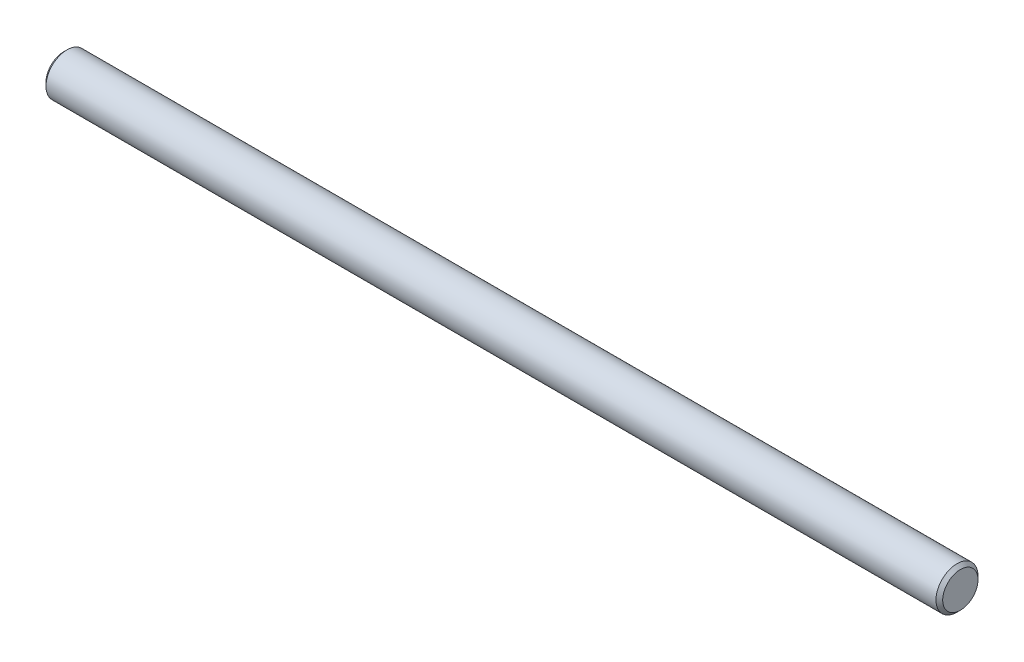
from build123d import *

# Parameters (mm, degrees)
SKETCH1_R      = 2.38125
EXTRUDE1_DEPTH = 50.8
CHAMFER1_SIZE  = 0.381


with BuildPart() as part:
    # Sketch1 → Extrude1 (new, symmetric)
    with BuildSketch(Plane(origin=(0, 0, 0), x_dir=(0, 0, -1), z_dir=(1, 0, 0))):
        Circle(SKETCH1_R)
    extrude(amount=EXTRUDE1_DEPTH, both=True)

    # Chamfer1
    chamfer1_edges = [part.edges().sort_by_distance(p)[0] for p in [
        (-50.8, 0, 2.38125),
        (50.8, 0, 2.38125),
    ]]
    chamfer(chamfer1_edges, length=CHAMFER1_SIZE)


solid = part.part
